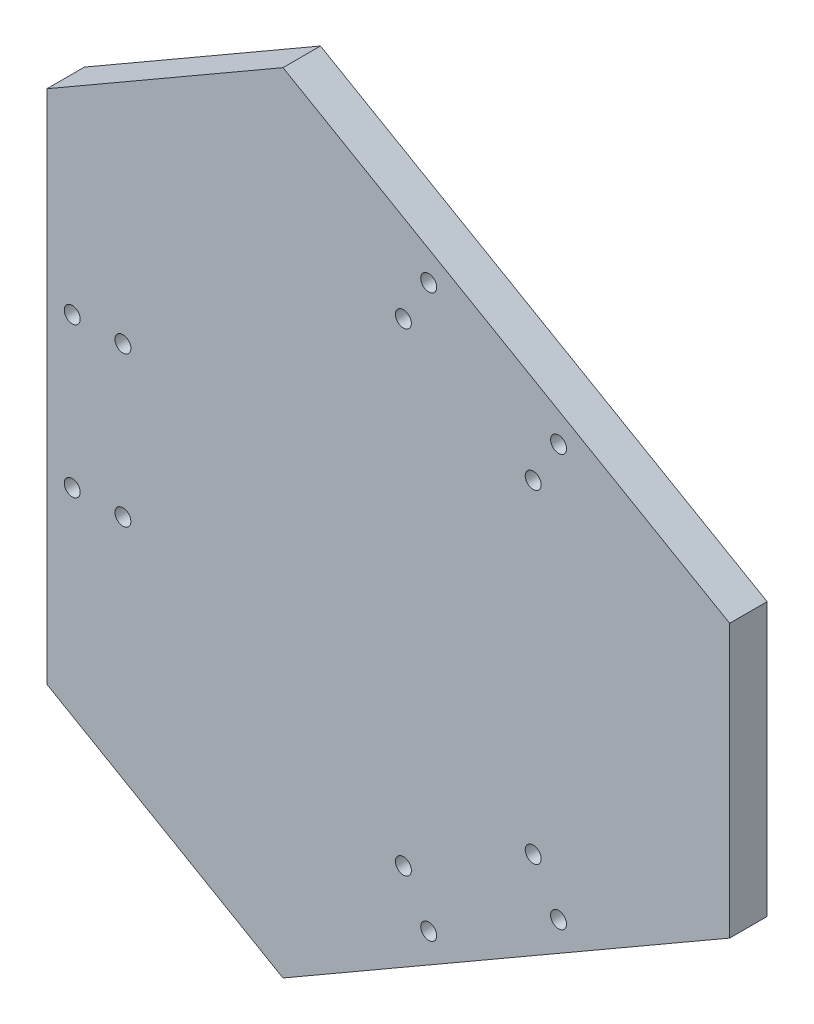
ISO-10303-21;
HEADER;
FILE_DESCRIPTION(('STEP AP214'),'2;1');
FILE_NAME('part.step','',(''),(''),'','','');
FILE_SCHEMA(('AUTOMOTIVE_DESIGN { 1 0 10303 214 1 1 1 1 }'));
ENDSEC;
DATA;
#1=APPLICATION_CONTEXT('core data for automotive mechanical design processes');
#2=APPLICATION_PROTOCOL_DEFINITION('international standard','automotive_design',2000,#1);
#3=PRODUCT_CONTEXT('',#1,'mechanical');
#4=PRODUCT('Part','Part','',(#3));
#5=PRODUCT_RELATED_PRODUCT_CATEGORY('part','',(#4));
#6=PRODUCT_DEFINITION_FORMATION('','',#4);
#7=PRODUCT_DEFINITION_CONTEXT('part definition',#1,'design');
#8=PRODUCT_DEFINITION('design','',#6,#7);
#9=PRODUCT_DEFINITION_SHAPE('','',#8);
#10=(LENGTH_UNIT() NAMED_UNIT(*) SI_UNIT(.MILLI.,.METRE.));
#11=(NAMED_UNIT(*) PLANE_ANGLE_UNIT() SI_UNIT($,.RADIAN.));
#12=(NAMED_UNIT(*) SI_UNIT($,.STERADIAN.) SOLID_ANGLE_UNIT());
#13=UNCERTAINTY_MEASURE_WITH_UNIT(LENGTH_MEASURE(1.E-05),#10,'distance_accuracy_value','');
#14=(GEOMETRIC_REPRESENTATION_CONTEXT(3) GLOBAL_UNCERTAINTY_ASSIGNED_CONTEXT((#13)) GLOBAL_UNIT_ASSIGNED_CONTEXT((#10,
#11,#12)) REPRESENTATION_CONTEXT('',''));
#15=CARTESIAN_POINT('',(0.,0.,0.));
#16=DIRECTION('',(0.,0.,1.));
#17=DIRECTION('',(1.,0.,0.));
#18=AXIS2_PLACEMENT_3D('',#15,#16,#17);
#19=CARTESIAN_POINT('',(0.,0.,-6.35));
#20=DIRECTION('',(0.,0.,-1.));
#21=DIRECTION('',(-1.,0.,0.));
#22=AXIS2_PLACEMENT_3D('',#19,#20,#21);
#23=PLANE('',#22);
#24=CARTESIAN_POINT('',(17.0100374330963,-80.2622490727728,-6.35));
#25=DIRECTION('',(0.,0.,-1.));
#26=DIRECTION('',(-1.,0.,0.));
#27=AXIS2_PLACEMENT_3D('',#24,#25,#26);
#28=CIRCLE('',#27,2.7051);
#29=CARTESIAN_POINT('',(14.3049374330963,-80.2622490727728,-6.35));
#30=VERTEX_POINT('',#29);
#31=EDGE_CURVE('E393',#30,#30,#28,.F.);
#32=ORIENTED_EDGE('',*,*,#31,.T.);
#33=EDGE_LOOP('',(#32));
#34=FACE_BOUND('',#33,.T.);
#35=CARTESIAN_POINT('',(-78.0141653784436,25.4000000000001,-6.35));
#36=DIRECTION('',(0.,0.,-1.));
#37=DIRECTION('',(-1.,0.,0.));
#38=AXIS2_PLACEMENT_3D('',#35,#36,#37);
#39=CIRCLE('',#38,2.7051);
#40=CARTESIAN_POINT('',(-80.7192653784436,25.4000000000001,-6.35));
#41=VERTEX_POINT('',#40);
#42=EDGE_CURVE('E462',#41,#41,#39,.F.);
#43=ORIENTED_EDGE('',*,*,#42,.T.);
#44=EDGE_LOOP('',(#43));
#45=FACE_BOUND('',#44,.T.);
#46=CARTESIAN_POINT('',(-95.1909153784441,-25.4,-6.35));
#47=DIRECTION('',(0.,0.,-1.));
#48=DIRECTION('',(-1.,0.,0.));
#49=AXIS2_PLACEMENT_3D('',#46,#47,#48);
#50=CIRCLE('',#49,2.7051);
#51=CARTESIAN_POINT('',(-97.8960153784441,-25.4,-6.35));
#52=VERTEX_POINT('',#51);
#53=EDGE_CURVE('E196',#52,#52,#50,.F.);
#54=ORIENTED_EDGE('',*,*,#53,.T.);
#55=EDGE_LOOP('',(#54));
#56=FACE_BOUND('',#55,.T.);
#57=CARTESIAN_POINT('',(-78.0141653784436,-25.4,-6.35));
#58=DIRECTION('',(0.,0.,-1.));
#59=DIRECTION('',(-1.,0.,0.));
#60=AXIS2_PLACEMENT_3D('',#57,#58,#59);
#61=CIRCLE('',#60,2.7051);
#62=CARTESIAN_POINT('',(-80.7192653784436,-25.4,-6.35));
#63=VERTEX_POINT('',#62);
#64=EDGE_CURVE('E187',#63,#63,#61,.F.);
#65=ORIENTED_EDGE('',*,*,#64,.T.);
#66=EDGE_LOOP('',(#65));
#67=FACE_BOUND('',#66,.T.);
#68=DIRECTION('',(0.866025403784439,0.499999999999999,0.));
#69=VECTOR('',#68,1.);
#70=CARTESIAN_POINT('',(127.558580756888,-46.1880215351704,-6.35));
#71=LINE('',#70,#69);
#72=CARTESIAN_POINT('',(-23.7792903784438,-133.562982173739,-6.35));
#73=VERTEX_POINT('',#72);
#74=CARTESIAN_POINT('',(127.558580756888,-46.1880215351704,-6.35));
#75=VERTEX_POINT('',#74);
#76=EDGE_CURVE('E168',#73,#75,#71,.T.);
#77=ORIENTED_EDGE('',*,*,#76,.F.);
#78=DIRECTION('',(0.866025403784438,-0.5,0.));
#79=VECTOR('',#78,1.);
#80=CARTESIAN_POINT('',(-23.7792903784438,-133.562982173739,-6.35));
#81=LINE('',#80,#79);
#82=CARTESIAN_POINT('',(-103.779290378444,-87.3749606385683,-6.35));
#83=VERTEX_POINT('',#82);
#84=EDGE_CURVE('E128',#83,#73,#81,.T.);
#85=ORIENTED_EDGE('',*,*,#84,.F.);
#86=DIRECTION('',(0.,-1.,0.));
#87=VECTOR('',#86,1.);
#88=CARTESIAN_POINT('',(-103.779290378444,87.3749606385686,-6.35));
#89=LINE('',#88,#87);
#90=CARTESIAN_POINT('',(-103.779290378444,87.3749606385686,-6.35));
#91=VERTEX_POINT('',#90);
#92=EDGE_CURVE('E112',#91,#83,#89,.T.);
#93=ORIENTED_EDGE('',*,*,#92,.F.);
#94=DIRECTION('',(-0.866025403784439,-0.5,0.));
#95=VECTOR('',#94,1.);
#96=CARTESIAN_POINT('',(-103.779290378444,87.3749606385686,-6.35));
#97=LINE('',#96,#95);
#98=CARTESIAN_POINT('',(-23.7792903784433,133.562982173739,-6.35));
#99=VERTEX_POINT('',#98);
#100=EDGE_CURVE('E126',#99,#91,#97,.T.);
#101=ORIENTED_EDGE('',*,*,#100,.F.);
#102=DIRECTION('',(-0.866025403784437,0.500000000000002,0.));
#103=VECTOR('',#102,1.);
#104=CARTESIAN_POINT('',(127.558580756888,46.1880215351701,-6.35));
#105=LINE('',#104,#103);
#106=CARTESIAN_POINT('',(127.558580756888,46.1880215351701,-6.35));
#107=VERTEX_POINT('',#106);
#108=EDGE_CURVE('E133',#107,#99,#105,.T.);
#109=ORIENTED_EDGE('',*,*,#108,.F.);
#110=DIRECTION('',(0.,1.,0.));
#111=VECTOR('',#110,1.);
#112=CARTESIAN_POINT('',(127.558580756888,46.1880215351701,-6.35));
#113=LINE('',#112,#111);
#114=EDGE_CURVE('E136',#75,#107,#113,.T.);
#115=ORIENTED_EDGE('',*,*,#114,.F.);
#116=EDGE_LOOP('',(#77,#85,#93,#101,#109,#115));
#117=FACE_BOUND('',#116,.T.);
#118=CARTESIAN_POINT('',(-95.190915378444,25.4000000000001,-6.35));
#119=DIRECTION('',(0.,0.,-1.));
#120=DIRECTION('',(-1.,0.,0.));
#121=AXIS2_PLACEMENT_3D('',#118,#119,#120);
#122=CIRCLE('',#121,2.7051);
#123=CARTESIAN_POINT('',(-97.896015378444,25.4000000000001,-6.35));
#124=VERTEX_POINT('',#123);
#125=EDGE_CURVE('E470',#124,#124,#122,.F.);
#126=ORIENTED_EDGE('',*,*,#125,.T.);
#127=EDGE_LOOP('',(#126));
#128=FACE_BOUND('',#127,.T.);
#129=CARTESIAN_POINT('',(17.0100374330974,80.2622490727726,-6.35));
#130=DIRECTION('',(0.,0.,-1.));
#131=DIRECTION('',(-1.,0.,0.));
#132=AXIS2_PLACEMENT_3D('',#129,#130,#131);
#133=CIRCLE('',#132,2.7051);
#134=CARTESIAN_POINT('',(14.3049374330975,80.2622490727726,-6.35));
#135=VERTEX_POINT('',#134);
#136=EDGE_CURVE('E454',#135,#135,#133,.F.);
#137=ORIENTED_EDGE('',*,*,#136,.T.);
#138=EDGE_LOOP('',(#137));
#139=FACE_BOUND('',#138,.T.);
#140=CARTESIAN_POINT('',(25.5984124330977,95.1377509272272,-6.35));
#141=DIRECTION('',(0.,0.,-1.));
#142=DIRECTION('',(-1.,0.,0.));
#143=AXIS2_PLACEMENT_3D('',#140,#141,#142);
#144=CIRCLE('',#143,2.7051);
#145=CARTESIAN_POINT('',(22.8933124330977,95.1377509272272,-6.35));
#146=VERTEX_POINT('',#145);
#147=EDGE_CURVE('E446',#146,#146,#144,.F.);
#148=ORIENTED_EDGE('',*,*,#147,.T.);
#149=EDGE_LOOP('',(#148));
#150=FACE_BOUND('',#149,.T.);
#151=CARTESIAN_POINT('',(69.5925029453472,69.737750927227,-6.35));
#152=DIRECTION('',(0.,0.,-1.));
#153=DIRECTION('',(-1.,0.,0.));
#154=AXIS2_PLACEMENT_3D('',#151,#152,#153);
#155=CIRCLE('',#154,2.7051);
#156=CARTESIAN_POINT('',(66.8874029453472,69.737750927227,-6.35));
#157=VERTEX_POINT('',#156);
#158=EDGE_CURVE('E438',#157,#157,#155,.F.);
#159=ORIENTED_EDGE('',*,*,#158,.T.);
#160=EDGE_LOOP('',(#159));
#161=FACE_BOUND('',#160,.T.);
#162=CARTESIAN_POINT('',(61.0041279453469,54.8622490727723,-6.35));
#163=DIRECTION('',(0.,0.,-1.));
#164=DIRECTION('',(-1.,0.,0.));
#165=AXIS2_PLACEMENT_3D('',#162,#163,#164);
#166=CIRCLE('',#165,2.7051);
#167=CARTESIAN_POINT('',(58.2990279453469,54.8622490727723,-6.35));
#168=VERTEX_POINT('',#167);
#169=EDGE_CURVE('E430',#168,#168,#166,.F.);
#170=ORIENTED_EDGE('',*,*,#169,.T.);
#171=EDGE_LOOP('',(#170));
#172=FACE_BOUND('',#171,.T.);
#173=CARTESIAN_POINT('',(61.0041279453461,-54.8622490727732,-6.35));
#174=DIRECTION('',(0.,0.,-1.));
#175=DIRECTION('',(-1.,0.,0.));
#176=AXIS2_PLACEMENT_3D('',#173,#174,#175);
#177=CIRCLE('',#176,2.70509999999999);
#178=CARTESIAN_POINT('',(58.2990279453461,-54.8622490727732,-6.35));
#179=VERTEX_POINT('',#178);
#180=EDGE_CURVE('E422',#179,#179,#177,.F.);
#181=ORIENTED_EDGE('',*,*,#180,.T.);
#182=EDGE_LOOP('',(#181));
#183=FACE_BOUND('',#182,.T.);
#184=CARTESIAN_POINT('',(69.5925029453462,-69.737750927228,-6.35));
#185=DIRECTION('',(0.,0.,-1.));
#186=DIRECTION('',(-1.,0.,0.));
#187=AXIS2_PLACEMENT_3D('',#184,#185,#186);
#188=CIRCLE('',#187,2.7051);
#189=CARTESIAN_POINT('',(66.8874029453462,-69.737750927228,-6.35));
#190=VERTEX_POINT('',#189);
#191=EDGE_CURVE('E414',#190,#190,#188,.F.);
#192=ORIENTED_EDGE('',*,*,#191,.T.);
#193=EDGE_LOOP('',(#192));
#194=FACE_BOUND('',#193,.T.);
#195=CARTESIAN_POINT('',(25.5984124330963,-95.1377509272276,-6.35));
#196=DIRECTION('',(0.,0.,-1.));
#197=DIRECTION('',(-1.,0.,0.));
#198=AXIS2_PLACEMENT_3D('',#195,#196,#197);
#199=CIRCLE('',#198,2.7051);
#200=CARTESIAN_POINT('',(22.8933124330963,-95.1377509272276,-6.35));
#201=VERTEX_POINT('',#200);
#202=EDGE_CURVE('E406',#201,#201,#199,.F.);
#203=ORIENTED_EDGE('',*,*,#202,.T.);
#204=EDGE_LOOP('',(#203));
#205=FACE_BOUND('',#204,.T.);
#206=ADVANCED_FACE('F50',(#34,#45,#56,#67,#117,#128,#139,#150,#161,#172,#183,#194,#205),#23,.T.);
#207=CARTESIAN_POINT('',(127.558580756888,-46.1880215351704,-6.35));
#208=DIRECTION('',(0.499999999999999,-0.866025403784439,0.));
#209=DIRECTION('',(0.866025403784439,0.499999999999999,0.));
#210=AXIS2_PLACEMENT_3D('',#207,#208,#209);
#211=PLANE('',#210);
#212=DIRECTION('',(0.866025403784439,0.499999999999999,0.));
#213=VECTOR('',#212,1.);
#214=CARTESIAN_POINT('',(127.558580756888,-46.1880215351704,6.35));
#215=LINE('',#214,#213);
#216=CARTESIAN_POINT('',(-23.7792903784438,-133.562982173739,6.35));
#217=VERTEX_POINT('',#216);
#218=CARTESIAN_POINT('',(127.558580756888,-46.1880215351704,6.35));
#219=VERTEX_POINT('',#218);
#220=EDGE_CURVE('E185',#217,#219,#215,.T.);
#221=ORIENTED_EDGE('',*,*,#220,.F.);
#222=DIRECTION('',(0.,0.,1.));
#223=VECTOR('',#222,1.);
#224=CARTESIAN_POINT('',(-23.7792903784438,-133.562982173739,-6.35));
#225=LINE('',#224,#223);
#226=EDGE_CURVE('E12',#73,#217,#225,.T.);
#227=ORIENTED_EDGE('',*,*,#226,.F.);
#228=ORIENTED_EDGE('',*,*,#76,.T.);
#229=DIRECTION('',(0.,0.,1.));
#230=VECTOR('',#229,1.);
#231=CARTESIAN_POINT('',(127.558580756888,-46.1880215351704,-6.35));
#232=LINE('',#231,#230);
#233=EDGE_CURVE('E54',#75,#219,#232,.T.);
#234=ORIENTED_EDGE('',*,*,#233,.T.);
#235=EDGE_LOOP('',(#221,#227,#228,#234));
#236=FACE_BOUND('',#235,.T.);
#237=ADVANCED_FACE('F52',(#236),#211,.T.);
#238=CARTESIAN_POINT('',(-23.7792903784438,-133.562982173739,-6.35));
#239=DIRECTION('',(-0.5,-0.866025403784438,0.));
#240=DIRECTION('',(0.866025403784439,-0.5,0.));
#241=AXIS2_PLACEMENT_3D('',#238,#239,#240);
#242=PLANE('',#241);
#243=DIRECTION('',(0.866025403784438,-0.5,0.));
#244=VECTOR('',#243,1.);
#245=CARTESIAN_POINT('',(-23.7792903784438,-133.562982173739,6.35));
#246=LINE('',#245,#244);
#247=CARTESIAN_POINT('',(-103.779290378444,-87.3749606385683,6.35));
#248=VERTEX_POINT('',#247);
#249=EDGE_CURVE('E164',#248,#217,#246,.T.);
#250=ORIENTED_EDGE('',*,*,#249,.F.);
#251=DIRECTION('',(0.,0.,1.));
#252=VECTOR('',#251,1.);
#253=CARTESIAN_POINT('',(-103.779290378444,-87.3749606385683,-6.35));
#254=LINE('',#253,#252);
#255=EDGE_CURVE('E61',#83,#248,#254,.T.);
#256=ORIENTED_EDGE('',*,*,#255,.F.);
#257=ORIENTED_EDGE('',*,*,#84,.T.);
#258=ORIENTED_EDGE('',*,*,#226,.T.);
#259=EDGE_LOOP('',(#250,#256,#257,#258));
#260=FACE_BOUND('',#259,.T.);
#261=ADVANCED_FACE('F162',(#260),#242,.T.);
#262=CARTESIAN_POINT('',(-103.779290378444,87.3749606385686,-6.35));
#263=DIRECTION('',(-1.,0.,0.));
#264=DIRECTION('',(0.,-1.,0.));
#265=AXIS2_PLACEMENT_3D('',#262,#263,#264);
#266=PLANE('',#265);
#267=DIRECTION('',(0.,-1.,0.));
#268=VECTOR('',#267,1.);
#269=CARTESIAN_POINT('',(-103.779290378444,87.3749606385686,6.35));
#270=LINE('',#269,#268);
#271=CARTESIAN_POINT('',(-103.779290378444,87.3749606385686,6.35));
#272=VERTEX_POINT('',#271);
#273=EDGE_CURVE('E114',#272,#248,#270,.T.);
#274=ORIENTED_EDGE('',*,*,#273,.F.);
#275=DIRECTION('',(0.,0.,1.));
#276=VECTOR('',#275,1.);
#277=CARTESIAN_POINT('',(-103.779290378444,87.3749606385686,-6.35));
#278=LINE('',#277,#276);
#279=EDGE_CURVE('E109',#91,#272,#278,.T.);
#280=ORIENTED_EDGE('',*,*,#279,.F.);
#281=ORIENTED_EDGE('',*,*,#92,.T.);
#282=ORIENTED_EDGE('',*,*,#255,.T.);
#283=EDGE_LOOP('',(#274,#280,#281,#282));
#284=FACE_BOUND('',#283,.T.);
#285=ADVANCED_FACE('F111',(#284),#266,.T.);
#286=CARTESIAN_POINT('',(-103.779290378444,87.3749606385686,-6.35));
#287=DIRECTION('',(-0.5,0.866025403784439,0.));
#288=DIRECTION('',(-0.866025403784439,-0.5,0.));
#289=AXIS2_PLACEMENT_3D('',#286,#287,#288);
#290=PLANE('',#289);
#291=DIRECTION('',(-0.866025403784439,-0.5,0.));
#292=VECTOR('',#291,1.);
#293=CARTESIAN_POINT('',(-103.779290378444,87.3749606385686,6.35));
#294=LINE('',#293,#292);
#295=CARTESIAN_POINT('',(-23.7792903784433,133.562982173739,6.35));
#296=VERTEX_POINT('',#295);
#297=EDGE_CURVE('E172',#296,#272,#294,.T.);
#298=ORIENTED_EDGE('',*,*,#297,.F.);
#299=DIRECTION('',(0.,0.,1.));
#300=VECTOR('',#299,1.);
#301=CARTESIAN_POINT('',(-23.7792903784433,133.562982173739,-6.35));
#302=LINE('',#301,#300);
#303=EDGE_CURVE('E120',#99,#296,#302,.T.);
#304=ORIENTED_EDGE('',*,*,#303,.F.);
#305=ORIENTED_EDGE('',*,*,#100,.T.);
#306=ORIENTED_EDGE('',*,*,#279,.T.);
#307=EDGE_LOOP('',(#298,#304,#305,#306));
#308=FACE_BOUND('',#307,.T.);
#309=ADVANCED_FACE('F131',(#308),#290,.T.);
#310=CARTESIAN_POINT('',(127.558580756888,46.1880215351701,-6.35));
#311=DIRECTION('',(0.500000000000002,0.866025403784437,0.));
#312=DIRECTION('',(-0.866025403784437,0.500000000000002,0.));
#313=AXIS2_PLACEMENT_3D('',#310,#311,#312);
#314=PLANE('',#313);
#315=DIRECTION('',(-0.866025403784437,0.500000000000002,0.));
#316=VECTOR('',#315,1.);
#317=CARTESIAN_POINT('',(127.558580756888,46.1880215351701,6.35));
#318=LINE('',#317,#316);
#319=CARTESIAN_POINT('',(127.558580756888,46.1880215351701,6.35));
#320=VERTEX_POINT('',#319);
#321=EDGE_CURVE('E178',#320,#296,#318,.T.);
#322=ORIENTED_EDGE('',*,*,#321,.F.);
#323=DIRECTION('',(0.,0.,1.));
#324=VECTOR('',#323,1.);
#325=CARTESIAN_POINT('',(127.558580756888,46.1880215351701,-6.35));
#326=LINE('',#325,#324);
#327=EDGE_CURVE('E156',#107,#320,#326,.T.);
#328=ORIENTED_EDGE('',*,*,#327,.F.);
#329=ORIENTED_EDGE('',*,*,#108,.T.);
#330=ORIENTED_EDGE('',*,*,#303,.T.);
#331=EDGE_LOOP('',(#322,#328,#329,#330));
#332=FACE_BOUND('',#331,.T.);
#333=ADVANCED_FACE('F227',(#332),#314,.T.);
#334=CARTESIAN_POINT('',(127.558580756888,46.1880215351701,-6.35));
#335=DIRECTION('',(1.,0.,0.));
#336=DIRECTION('',(0.,1.,0.));
#337=AXIS2_PLACEMENT_3D('',#334,#335,#336);
#338=PLANE('',#337);
#339=DIRECTION('',(0.,1.,0.));
#340=VECTOR('',#339,1.);
#341=CARTESIAN_POINT('',(127.558580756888,46.1880215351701,6.35));
#342=LINE('',#341,#340);
#343=EDGE_CURVE('E181',#219,#320,#342,.T.);
#344=ORIENTED_EDGE('',*,*,#343,.F.);
#345=ORIENTED_EDGE('',*,*,#233,.F.);
#346=ORIENTED_EDGE('',*,*,#114,.T.);
#347=ORIENTED_EDGE('',*,*,#327,.T.);
#348=EDGE_LOOP('',(#344,#345,#346,#347));
#349=FACE_BOUND('',#348,.T.);
#350=ADVANCED_FACE('F201',(#349),#338,.T.);
#351=CARTESIAN_POINT('',(0.,0.,6.35));
#352=DIRECTION('',(0.,0.,-1.));
#353=DIRECTION('',(-1.,0.,0.));
#354=AXIS2_PLACEMENT_3D('',#351,#352,#353);
#355=PLANE('',#354);
#356=CARTESIAN_POINT('',(17.0100374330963,-80.2622490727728,6.35));
#357=DIRECTION('',(0.,0.,1.));
#358=DIRECTION('',(1.,0.,0.));
#359=AXIS2_PLACEMENT_3D('',#356,#357,#358);
#360=CIRCLE('',#359,2.7051);
#361=CARTESIAN_POINT('',(19.7151374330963,-80.2622490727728,6.35));
#362=VERTEX_POINT('',#361);
#363=EDGE_CURVE('E396',#362,#362,#360,.T.);
#364=ORIENTED_EDGE('',*,*,#363,.F.);
#365=EDGE_LOOP('',(#364));
#366=FACE_BOUND('',#365,.T.);
#367=CARTESIAN_POINT('',(25.5984124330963,-95.1377509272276,6.35));
#368=DIRECTION('',(0.,0.,1.));
#369=DIRECTION('',(1.,0.,0.));
#370=AXIS2_PLACEMENT_3D('',#367,#368,#369);
#371=CIRCLE('',#370,2.7051);
#372=CARTESIAN_POINT('',(28.3035124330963,-95.1377509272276,6.35));
#373=VERTEX_POINT('',#372);
#374=EDGE_CURVE('E400',#373,#373,#371,.T.);
#375=ORIENTED_EDGE('',*,*,#374,.F.);
#376=EDGE_LOOP('',(#375));
#377=FACE_BOUND('',#376,.T.);
#378=CARTESIAN_POINT('',(69.5925029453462,-69.737750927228,6.35));
#379=DIRECTION('',(0.,0.,1.));
#380=DIRECTION('',(1.,0.,0.));
#381=AXIS2_PLACEMENT_3D('',#378,#379,#380);
#382=CIRCLE('',#381,2.7051);
#383=CARTESIAN_POINT('',(72.2976029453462,-69.737750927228,6.35));
#384=VERTEX_POINT('',#383);
#385=EDGE_CURVE('E410',#384,#384,#382,.T.);
#386=ORIENTED_EDGE('',*,*,#385,.F.);
#387=EDGE_LOOP('',(#386));
#388=FACE_BOUND('',#387,.T.);
#389=CARTESIAN_POINT('',(61.0041279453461,-54.8622490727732,6.35));
#390=DIRECTION('',(0.,0.,1.));
#391=DIRECTION('',(1.,0.,0.));
#392=AXIS2_PLACEMENT_3D('',#389,#390,#391);
#393=CIRCLE('',#392,2.70509999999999);
#394=CARTESIAN_POINT('',(63.7092279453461,-54.8622490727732,6.35));
#395=VERTEX_POINT('',#394);
#396=EDGE_CURVE('E418',#395,#395,#393,.T.);
#397=ORIENTED_EDGE('',*,*,#396,.F.);
#398=EDGE_LOOP('',(#397));
#399=FACE_BOUND('',#398,.T.);
#400=CARTESIAN_POINT('',(61.0041279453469,54.8622490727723,6.35));
#401=DIRECTION('',(0.,0.,1.));
#402=DIRECTION('',(1.,0.,0.));
#403=AXIS2_PLACEMENT_3D('',#400,#401,#402);
#404=CIRCLE('',#403,2.7051);
#405=CARTESIAN_POINT('',(63.7092279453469,54.8622490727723,6.35));
#406=VERTEX_POINT('',#405);
#407=EDGE_CURVE('E426',#406,#406,#404,.T.);
#408=ORIENTED_EDGE('',*,*,#407,.F.);
#409=EDGE_LOOP('',(#408));
#410=FACE_BOUND('',#409,.T.);
#411=CARTESIAN_POINT('',(69.5925029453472,69.737750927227,6.35));
#412=DIRECTION('',(0.,0.,1.));
#413=DIRECTION('',(1.,0.,0.));
#414=AXIS2_PLACEMENT_3D('',#411,#412,#413);
#415=CIRCLE('',#414,2.7051);
#416=CARTESIAN_POINT('',(72.2976029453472,69.737750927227,6.35));
#417=VERTEX_POINT('',#416);
#418=EDGE_CURVE('E434',#417,#417,#415,.T.);
#419=ORIENTED_EDGE('',*,*,#418,.F.);
#420=EDGE_LOOP('',(#419));
#421=FACE_BOUND('',#420,.T.);
#422=CARTESIAN_POINT('',(25.5984124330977,95.1377509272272,6.35));
#423=DIRECTION('',(0.,0.,1.));
#424=DIRECTION('',(1.,0.,0.));
#425=AXIS2_PLACEMENT_3D('',#422,#423,#424);
#426=CIRCLE('',#425,2.7051);
#427=CARTESIAN_POINT('',(28.3035124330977,95.1377509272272,6.35));
#428=VERTEX_POINT('',#427);
#429=EDGE_CURVE('E442',#428,#428,#426,.T.);
#430=ORIENTED_EDGE('',*,*,#429,.F.);
#431=EDGE_LOOP('',(#430));
#432=FACE_BOUND('',#431,.T.);
#433=CARTESIAN_POINT('',(17.0100374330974,80.2622490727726,6.35));
#434=DIRECTION('',(0.,0.,1.));
#435=DIRECTION('',(1.,0.,0.));
#436=AXIS2_PLACEMENT_3D('',#433,#434,#435);
#437=CIRCLE('',#436,2.7051);
#438=CARTESIAN_POINT('',(19.7151374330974,80.2622490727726,6.35));
#439=VERTEX_POINT('',#438);
#440=EDGE_CURVE('E450',#439,#439,#437,.T.);
#441=ORIENTED_EDGE('',*,*,#440,.F.);
#442=EDGE_LOOP('',(#441));
#443=FACE_BOUND('',#442,.T.);
#444=CARTESIAN_POINT('',(-78.0141653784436,25.4000000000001,6.35));
#445=DIRECTION('',(0.,0.,1.));
#446=DIRECTION('',(1.,0.,0.));
#447=AXIS2_PLACEMENT_3D('',#444,#445,#446);
#448=CIRCLE('',#447,2.7051);
#449=CARTESIAN_POINT('',(-75.3090653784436,25.4000000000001,6.35));
#450=VERTEX_POINT('',#449);
#451=EDGE_CURVE('E458',#450,#450,#448,.T.);
#452=ORIENTED_EDGE('',*,*,#451,.F.);
#453=EDGE_LOOP('',(#452));
#454=FACE_BOUND('',#453,.T.);
#455=CARTESIAN_POINT('',(-95.190915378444,25.4000000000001,6.35));
#456=DIRECTION('',(0.,0.,1.));
#457=DIRECTION('',(1.,0.,0.));
#458=AXIS2_PLACEMENT_3D('',#455,#456,#457);
#459=CIRCLE('',#458,2.7051);
#460=CARTESIAN_POINT('',(-92.485815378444,25.4000000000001,6.35));
#461=VERTEX_POINT('',#460);
#462=EDGE_CURVE('E466',#461,#461,#459,.T.);
#463=ORIENTED_EDGE('',*,*,#462,.F.);
#464=EDGE_LOOP('',(#463));
#465=FACE_BOUND('',#464,.T.);
#466=CARTESIAN_POINT('',(-95.1909153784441,-25.4,6.35));
#467=DIRECTION('',(0.,0.,1.));
#468=DIRECTION('',(1.,0.,0.));
#469=AXIS2_PLACEMENT_3D('',#466,#467,#468);
#470=CIRCLE('',#469,2.7051);
#471=CARTESIAN_POINT('',(-92.4858153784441,-25.4,6.35));
#472=VERTEX_POINT('',#471);
#473=EDGE_CURVE('E474',#472,#472,#470,.T.);
#474=ORIENTED_EDGE('',*,*,#473,.F.);
#475=EDGE_LOOP('',(#474));
#476=FACE_BOUND('',#475,.T.);
#477=CARTESIAN_POINT('',(-78.0141653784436,-25.4,6.35));
#478=DIRECTION('',(0.,0.,1.));
#479=DIRECTION('',(1.,0.,0.));
#480=AXIS2_PLACEMENT_3D('',#477,#478,#479);
#481=CIRCLE('',#480,2.7051);
#482=CARTESIAN_POINT('',(-75.3090653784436,-25.4,6.35));
#483=VERTEX_POINT('',#482);
#484=EDGE_CURVE('E190',#483,#483,#481,.T.);
#485=ORIENTED_EDGE('',*,*,#484,.F.);
#486=EDGE_LOOP('',(#485));
#487=FACE_BOUND('',#486,.T.);
#488=ORIENTED_EDGE('',*,*,#220,.T.);
#489=ORIENTED_EDGE('',*,*,#343,.T.);
#490=ORIENTED_EDGE('',*,*,#321,.T.);
#491=ORIENTED_EDGE('',*,*,#297,.T.);
#492=ORIENTED_EDGE('',*,*,#273,.T.);
#493=ORIENTED_EDGE('',*,*,#249,.T.);
#494=EDGE_LOOP('',(#488,#489,#490,#491,#492,#493));
#495=FACE_BOUND('',#494,.T.);
#496=ADVANCED_FACE('F220',(#366,#377,#388,#399,#410,#421,#432,#443,#454,#465,#476,#487,#495),
#355,.F.);
#497=CARTESIAN_POINT('',(-78.0141653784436,-25.4,6.35));
#498=DIRECTION('',(0.,0.,1.));
#499=DIRECTION('',(1.,0.,0.));
#500=AXIS2_PLACEMENT_3D('',#497,#498,#499);
#501=CYLINDRICAL_SURFACE('',#500,2.7051);
#502=ORIENTED_EDGE('',*,*,#64,.F.);
#503=EDGE_LOOP('',(#502));
#504=FACE_BOUND('',#503,.T.);
#505=ORIENTED_EDGE('',*,*,#484,.T.);
#506=EDGE_LOOP('',(#505));
#507=FACE_BOUND('',#506,.T.);
#508=ADVANCED_FACE('F218',(#504,#507),#501,.F.);
#509=CARTESIAN_POINT('',(-95.1909153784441,-25.4,6.35));
#510=DIRECTION('',(0.,0.,1.));
#511=DIRECTION('',(1.,0.,0.));
#512=AXIS2_PLACEMENT_3D('',#509,#510,#511);
#513=CYLINDRICAL_SURFACE('',#512,2.7051);
#514=ORIENTED_EDGE('',*,*,#53,.F.);
#515=EDGE_LOOP('',(#514));
#516=FACE_BOUND('',#515,.T.);
#517=ORIENTED_EDGE('',*,*,#473,.T.);
#518=EDGE_LOOP('',(#517));
#519=FACE_BOUND('',#518,.T.);
#520=ADVANCED_FACE('F278',(#516,#519),#513,.F.);
#521=CARTESIAN_POINT('',(-95.190915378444,25.4000000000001,6.35));
#522=DIRECTION('',(0.,0.,1.));
#523=DIRECTION('',(1.,0.,0.));
#524=AXIS2_PLACEMENT_3D('',#521,#522,#523);
#525=CYLINDRICAL_SURFACE('',#524,2.7051);
#526=ORIENTED_EDGE('',*,*,#125,.F.);
#527=EDGE_LOOP('',(#526));
#528=FACE_BOUND('',#527,.T.);
#529=ORIENTED_EDGE('',*,*,#462,.T.);
#530=EDGE_LOOP('',(#529));
#531=FACE_BOUND('',#530,.T.);
#532=ADVANCED_FACE('F286',(#528,#531),#525,.F.);
#533=CARTESIAN_POINT('',(-78.0141653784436,25.4000000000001,6.35));
#534=DIRECTION('',(0.,0.,1.));
#535=DIRECTION('',(1.,0.,0.));
#536=AXIS2_PLACEMENT_3D('',#533,#534,#535);
#537=CYLINDRICAL_SURFACE('',#536,2.7051);
#538=ORIENTED_EDGE('',*,*,#42,.F.);
#539=EDGE_LOOP('',(#538));
#540=FACE_BOUND('',#539,.T.);
#541=ORIENTED_EDGE('',*,*,#451,.T.);
#542=EDGE_LOOP('',(#541));
#543=FACE_BOUND('',#542,.T.);
#544=ADVANCED_FACE('F294',(#540,#543),#537,.F.);
#545=CARTESIAN_POINT('',(17.0100374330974,80.2622490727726,6.35));
#546=DIRECTION('',(0.,0.,1.));
#547=DIRECTION('',(1.,0.,0.));
#548=AXIS2_PLACEMENT_3D('',#545,#546,#547);
#549=CYLINDRICAL_SURFACE('',#548,2.7051);
#550=ORIENTED_EDGE('',*,*,#136,.F.);
#551=EDGE_LOOP('',(#550));
#552=FACE_BOUND('',#551,.T.);
#553=ORIENTED_EDGE('',*,*,#440,.T.);
#554=EDGE_LOOP('',(#553));
#555=FACE_BOUND('',#554,.T.);
#556=ADVANCED_FACE('F303',(#552,#555),#549,.F.);
#557=CARTESIAN_POINT('',(25.5984124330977,95.1377509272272,6.35));
#558=DIRECTION('',(0.,0.,1.));
#559=DIRECTION('',(1.,0.,0.));
#560=AXIS2_PLACEMENT_3D('',#557,#558,#559);
#561=CYLINDRICAL_SURFACE('',#560,2.7051);
#562=ORIENTED_EDGE('',*,*,#147,.F.);
#563=EDGE_LOOP('',(#562));
#564=FACE_BOUND('',#563,.T.);
#565=ORIENTED_EDGE('',*,*,#429,.T.);
#566=EDGE_LOOP('',(#565));
#567=FACE_BOUND('',#566,.T.);
#568=ADVANCED_FACE('F312',(#564,#567),#561,.F.);
#569=CARTESIAN_POINT('',(69.5925029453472,69.737750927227,6.35));
#570=DIRECTION('',(0.,0.,1.));
#571=DIRECTION('',(1.,0.,0.));
#572=AXIS2_PLACEMENT_3D('',#569,#570,#571);
#573=CYLINDRICAL_SURFACE('',#572,2.7051);
#574=ORIENTED_EDGE('',*,*,#158,.F.);
#575=EDGE_LOOP('',(#574));
#576=FACE_BOUND('',#575,.T.);
#577=ORIENTED_EDGE('',*,*,#418,.T.);
#578=EDGE_LOOP('',(#577));
#579=FACE_BOUND('',#578,.T.);
#580=ADVANCED_FACE('F321',(#576,#579),#573,.F.);
#581=CARTESIAN_POINT('',(61.0041279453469,54.8622490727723,6.35));
#582=DIRECTION('',(0.,0.,1.));
#583=DIRECTION('',(1.,0.,0.));
#584=AXIS2_PLACEMENT_3D('',#581,#582,#583);
#585=CYLINDRICAL_SURFACE('',#584,2.7051);
#586=ORIENTED_EDGE('',*,*,#169,.F.);
#587=EDGE_LOOP('',(#586));
#588=FACE_BOUND('',#587,.T.);
#589=ORIENTED_EDGE('',*,*,#407,.T.);
#590=EDGE_LOOP('',(#589));
#591=FACE_BOUND('',#590,.T.);
#592=ADVANCED_FACE('F330',(#588,#591),#585,.F.);
#593=CARTESIAN_POINT('',(61.0041279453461,-54.8622490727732,6.35));
#594=DIRECTION('',(0.,0.,1.));
#595=DIRECTION('',(1.,0.,0.));
#596=AXIS2_PLACEMENT_3D('',#593,#594,#595);
#597=CYLINDRICAL_SURFACE('',#596,2.70509999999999);
#598=ORIENTED_EDGE('',*,*,#180,.F.);
#599=EDGE_LOOP('',(#598));
#600=FACE_BOUND('',#599,.T.);
#601=ORIENTED_EDGE('',*,*,#396,.T.);
#602=EDGE_LOOP('',(#601));
#603=FACE_BOUND('',#602,.T.);
#604=ADVANCED_FACE('F339',(#600,#603),#597,.F.);
#605=CARTESIAN_POINT('',(69.5925029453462,-69.737750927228,6.35));
#606=DIRECTION('',(0.,0.,1.));
#607=DIRECTION('',(1.,0.,0.));
#608=AXIS2_PLACEMENT_3D('',#605,#606,#607);
#609=CYLINDRICAL_SURFACE('',#608,2.7051);
#610=ORIENTED_EDGE('',*,*,#191,.F.);
#611=EDGE_LOOP('',(#610));
#612=FACE_BOUND('',#611,.T.);
#613=ORIENTED_EDGE('',*,*,#385,.T.);
#614=EDGE_LOOP('',(#613));
#615=FACE_BOUND('',#614,.T.);
#616=ADVANCED_FACE('F348',(#612,#615),#609,.F.);
#617=CARTESIAN_POINT('',(25.5984124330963,-95.1377509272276,6.35));
#618=DIRECTION('',(0.,0.,1.));
#619=DIRECTION('',(1.,0.,0.));
#620=AXIS2_PLACEMENT_3D('',#617,#618,#619);
#621=CYLINDRICAL_SURFACE('',#620,2.7051);
#622=ORIENTED_EDGE('',*,*,#202,.F.);
#623=EDGE_LOOP('',(#622));
#624=FACE_BOUND('',#623,.T.);
#625=ORIENTED_EDGE('',*,*,#374,.T.);
#626=EDGE_LOOP('',(#625));
#627=FACE_BOUND('',#626,.T.);
#628=ADVANCED_FACE('F357',(#624,#627),#621,.F.);
#629=CARTESIAN_POINT('',(17.0100374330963,-80.2622490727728,6.35));
#630=DIRECTION('',(0.,0.,1.));
#631=DIRECTION('',(1.,0.,0.));
#632=AXIS2_PLACEMENT_3D('',#629,#630,#631);
#633=CYLINDRICAL_SURFACE('',#632,2.7051);
#634=ORIENTED_EDGE('',*,*,#31,.F.);
#635=EDGE_LOOP('',(#634));
#636=FACE_BOUND('',#635,.T.);
#637=ORIENTED_EDGE('',*,*,#363,.T.);
#638=EDGE_LOOP('',(#637));
#639=FACE_BOUND('',#638,.T.);
#640=ADVANCED_FACE('F366',(#636,#639),#633,.F.);
#641=CLOSED_SHELL('',(#206,#237,#261,#285,#309,#333,#350,#496,#508,#520,#532,#544,#556,#568,
#580,#592,#604,#616,#628,#640));
#642=MANIFOLD_SOLID_BREP('B2',#641);
#643=ADVANCED_BREP_SHAPE_REPRESENTATION('',(#18,#642),#14);
#644=SHAPE_DEFINITION_REPRESENTATION(#9,#643);
ENDSEC;
END-ISO-10303-21;
